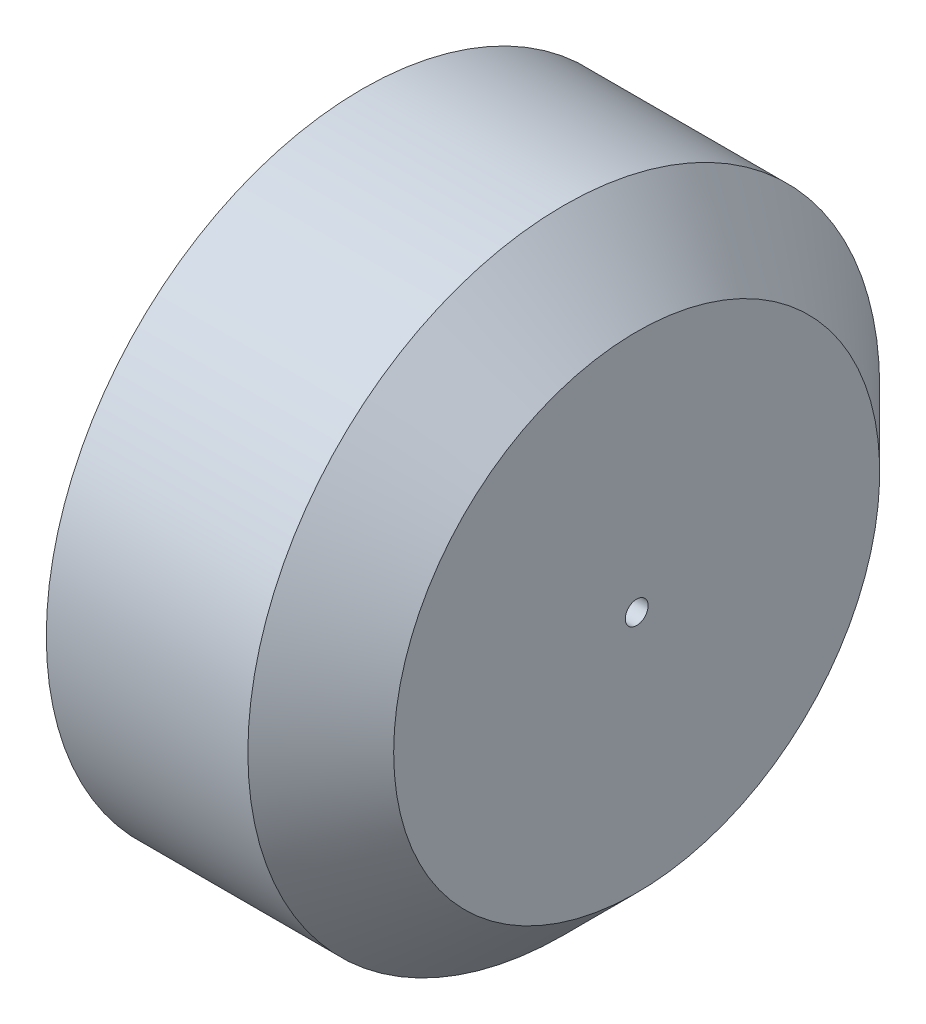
ISO-10303-21;
HEADER;
FILE_DESCRIPTION(('STEP AP214'),'2;1');
FILE_NAME('part.step','',(''),(''),'','','');
FILE_SCHEMA(('AUTOMOTIVE_DESIGN { 1 0 10303 214 1 1 1 1 }'));
ENDSEC;
DATA;
#1=APPLICATION_CONTEXT('core data for automotive mechanical design processes');
#2=APPLICATION_PROTOCOL_DEFINITION('international standard','automotive_design',2000,#1);
#3=PRODUCT_CONTEXT('',#1,'mechanical');
#4=PRODUCT('Part','Part','',(#3));
#5=PRODUCT_RELATED_PRODUCT_CATEGORY('part','',(#4));
#6=PRODUCT_DEFINITION_FORMATION('','',#4);
#7=PRODUCT_DEFINITION_CONTEXT('part definition',#1,'design');
#8=PRODUCT_DEFINITION('design','',#6,#7);
#9=PRODUCT_DEFINITION_SHAPE('','',#8);
#10=(LENGTH_UNIT() NAMED_UNIT(*) SI_UNIT(.MILLI.,.METRE.));
#11=(NAMED_UNIT(*) PLANE_ANGLE_UNIT() SI_UNIT($,.RADIAN.));
#12=(NAMED_UNIT(*) SI_UNIT($,.STERADIAN.) SOLID_ANGLE_UNIT());
#13=UNCERTAINTY_MEASURE_WITH_UNIT(LENGTH_MEASURE(1.E-05),#10,'distance_accuracy_value','');
#14=(GEOMETRIC_REPRESENTATION_CONTEXT(3) GLOBAL_UNCERTAINTY_ASSIGNED_CONTEXT((#13)) GLOBAL_UNIT_ASSIGNED_CONTEXT((#10,
#11,#12)) REPRESENTATION_CONTEXT('',''));
#15=CARTESIAN_POINT('',(0.,0.,0.));
#16=DIRECTION('',(0.,0.,1.));
#17=DIRECTION('',(1.,0.,0.));
#18=AXIS2_PLACEMENT_3D('',#15,#16,#17);
#19=CARTESIAN_POINT('',(437.,86.5,-20.));
#20=DIRECTION('',(1.,0.,0.));
#21=DIRECTION('',(0.,0.,-1.));
#22=AXIS2_PLACEMENT_3D('',#19,#20,#21);
#23=CYLINDRICAL_SURFACE('',#22,110.5);
#24=CARTESIAN_POINT('',(507.5,86.5,-20.));
#25=DIRECTION('',(-1.,0.,0.));
#26=DIRECTION('',(0.,1.,0.));
#27=AXIS2_PLACEMENT_3D('',#24,#25,#26);
#28=CIRCLE('',#27,110.5);
#29=CARTESIAN_POINT('',(507.5,197.,-20.));
#30=VERTEX_POINT('',#29);
#31=EDGE_CURVE('E42',#30,#30,#28,.F.);
#32=ORIENTED_EDGE('',*,*,#31,.F.);
#33=EDGE_LOOP('',(#32));
#34=FACE_BOUND('',#33,.T.);
#35=CARTESIAN_POINT('',(437.,86.5,-20.));
#36=DIRECTION('',(1.,0.,0.));
#37=DIRECTION('',(0.,0.,-1.));
#38=AXIS2_PLACEMENT_3D('',#35,#36,#37);
#39=CIRCLE('',#38,110.5);
#40=CARTESIAN_POINT('',(437.,86.5,-130.5));
#41=VERTEX_POINT('',#40);
#42=EDGE_CURVE('E39',#41,#41,#39,.F.);
#43=ORIENTED_EDGE('',*,*,#42,.F.);
#44=EDGE_LOOP('',(#43));
#45=FACE_BOUND('',#44,.T.);
#46=ADVANCED_FACE('F14',(#34,#45),#23,.T.);
#47=CARTESIAN_POINT('',(507.5,86.5,-20.));
#48=DIRECTION('',(-1.,0.,0.));
#49=DIRECTION('',(0.,0.,1.));
#50=AXIS2_PLACEMENT_3D('',#47,#48,#49);
#51=CONICAL_SURFACE('',#50,110.5,0.785398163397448);
#52=ORIENTED_EDGE('',*,*,#31,.T.);
#53=EDGE_LOOP('',(#52));
#54=FACE_BOUND('',#53,.T.);
#55=CARTESIAN_POINT('',(533.,86.5,-20.));
#56=DIRECTION('',(-1.,0.,0.));
#57=DIRECTION('',(0.,0.,1.));
#58=AXIS2_PLACEMENT_3D('',#55,#56,#57);
#59=CIRCLE('',#58,85.);
#60=CARTESIAN_POINT('',(533.,86.5,65.));
#61=VERTEX_POINT('',#60);
#62=EDGE_CURVE('E27',#61,#61,#59,.T.);
#63=ORIENTED_EDGE('',*,*,#62,.T.);
#64=EDGE_LOOP('',(#63));
#65=FACE_BOUND('',#64,.T.);
#66=ADVANCED_FACE('F48',(#54,#65),#51,.T.);
#67=CARTESIAN_POINT('',(437.,86.5,-20.));
#68=DIRECTION('',(-1.,0.,0.));
#69=DIRECTION('',(0.,0.,1.));
#70=AXIS2_PLACEMENT_3D('',#67,#68,#69);
#71=PLANE('',#70);
#72=ORIENTED_EDGE('',*,*,#42,.T.);
#73=EDGE_LOOP('',(#72));
#74=FACE_BOUND('',#73,.T.);
#75=CARTESIAN_POINT('',(437.,86.5,-20.));
#76=DIRECTION('',(1.,0.,0.));
#77=DIRECTION('',(0.,0.,-1.));
#78=AXIS2_PLACEMENT_3D('',#75,#76,#77);
#79=CIRCLE('',#78,4.);
#80=CARTESIAN_POINT('',(437.,86.5,-24.));
#81=VERTEX_POINT('',#80);
#82=EDGE_CURVE('E22',#81,#81,#79,.T.);
#83=ORIENTED_EDGE('',*,*,#82,.T.);
#84=EDGE_LOOP('',(#83));
#85=FACE_BOUND('',#84,.T.);
#86=ADVANCED_FACE('F58',(#74,#85),#71,.T.);
#87=CARTESIAN_POINT('',(533.,86.5,-20.));
#88=DIRECTION('',(-1.,0.,0.));
#89=DIRECTION('',(0.,0.,1.));
#90=AXIS2_PLACEMENT_3D('',#87,#88,#89);
#91=PLANE('',#90);
#92=ORIENTED_EDGE('',*,*,#62,.F.);
#93=EDGE_LOOP('',(#92));
#94=FACE_BOUND('',#93,.T.);
#95=CARTESIAN_POINT('',(533.,86.5,-20.));
#96=DIRECTION('',(1.,0.,0.));
#97=DIRECTION('',(0.,0.,-1.));
#98=AXIS2_PLACEMENT_3D('',#95,#96,#97);
#99=CIRCLE('',#98,4.);
#100=CARTESIAN_POINT('',(533.,86.5,-24.));
#101=VERTEX_POINT('',#100);
#102=EDGE_CURVE('E10',#101,#101,#99,.F.);
#103=ORIENTED_EDGE('',*,*,#102,.T.);
#104=EDGE_LOOP('',(#103));
#105=FACE_BOUND('',#104,.T.);
#106=ADVANCED_FACE('F61',(#94,#105),#91,.F.);
#107=CARTESIAN_POINT('',(437.,86.5,-20.));
#108=DIRECTION('',(1.,0.,0.));
#109=DIRECTION('',(0.,0.,-1.));
#110=AXIS2_PLACEMENT_3D('',#107,#108,#109);
#111=CYLINDRICAL_SURFACE('',#110,4.);
#112=ORIENTED_EDGE('',*,*,#102,.F.);
#113=EDGE_LOOP('',(#112));
#114=FACE_BOUND('',#113,.T.);
#115=ORIENTED_EDGE('',*,*,#82,.F.);
#116=EDGE_LOOP('',(#115));
#117=FACE_BOUND('',#116,.T.);
#118=ADVANCED_FACE('F16',(#114,#117),#111,.F.);
#119=CLOSED_SHELL('',(#46,#66,#86,#106,#118));
#120=MANIFOLD_SOLID_BREP('B1',#119);
#121=ADVANCED_BREP_SHAPE_REPRESENTATION('',(#18,#120),#14);
#122=SHAPE_DEFINITION_REPRESENTATION(#9,#121);
ENDSEC;
END-ISO-10303-21;
